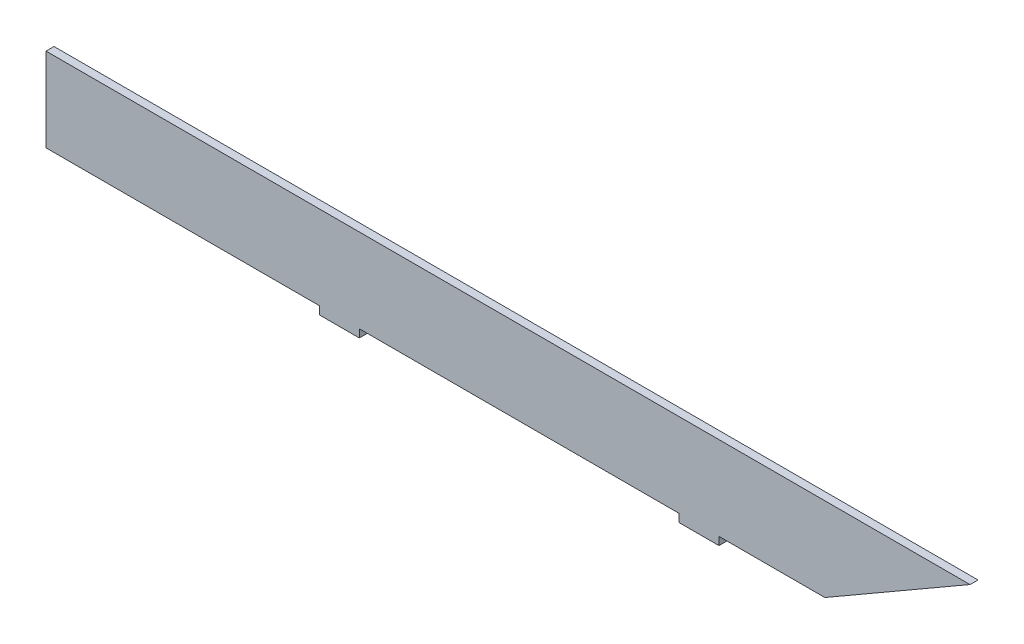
ISO-10303-21;
HEADER;
FILE_DESCRIPTION(('STEP AP214'),'2;1');
FILE_NAME('part.step','',(''),(''),'','','');
FILE_SCHEMA(('AUTOMOTIVE_DESIGN { 1 0 10303 214 1 1 1 1 }'));
ENDSEC;
DATA;
#1=APPLICATION_CONTEXT('core data for automotive mechanical design processes');
#2=APPLICATION_PROTOCOL_DEFINITION('international standard','automotive_design',2000,#1);
#3=PRODUCT_CONTEXT('',#1,'mechanical');
#4=PRODUCT('Part','Part','',(#3));
#5=PRODUCT_RELATED_PRODUCT_CATEGORY('part','',(#4));
#6=PRODUCT_DEFINITION_FORMATION('','',#4);
#7=PRODUCT_DEFINITION_CONTEXT('part definition',#1,'design');
#8=PRODUCT_DEFINITION('design','',#6,#7);
#9=PRODUCT_DEFINITION_SHAPE('','',#8);
#10=(LENGTH_UNIT() NAMED_UNIT(*) SI_UNIT(.MILLI.,.METRE.));
#11=(NAMED_UNIT(*) PLANE_ANGLE_UNIT() SI_UNIT($,.RADIAN.));
#12=(NAMED_UNIT(*) SI_UNIT($,.STERADIAN.) SOLID_ANGLE_UNIT());
#13=UNCERTAINTY_MEASURE_WITH_UNIT(LENGTH_MEASURE(1.E-05),#10,'distance_accuracy_value','');
#14=(GEOMETRIC_REPRESENTATION_CONTEXT(3) GLOBAL_UNCERTAINTY_ASSIGNED_CONTEXT((#13)) GLOBAL_UNIT_ASSIGNED_CONTEXT((#10,
#11,#12)) REPRESENTATION_CONTEXT('',''));
#15=CARTESIAN_POINT('',(0.,0.,0.));
#16=DIRECTION('',(0.,0.,1.));
#17=DIRECTION('',(1.,0.,0.));
#18=AXIS2_PLACEMENT_3D('',#15,#16,#17);
#19=CARTESIAN_POINT('',(0.,0.,2.));
#20=DIRECTION('',(0.,0.,1.));
#21=DIRECTION('',(1.,0.,0.));
#22=AXIS2_PLACEMENT_3D('',#19,#20,#21);
#23=PLANE('',#22);
#24=DIRECTION('',(0.,1.,0.));
#25=VECTOR('',#24,1.);
#26=CARTESIAN_POINT('',(168.6,-2.,2.));
#27=LINE('',#26,#25);
#28=CARTESIAN_POINT('',(168.6,0.,2.));
#29=VERTEX_POINT('',#28);
#30=CARTESIAN_POINT('',(168.6,-2.,2.));
#31=VERTEX_POINT('',#30);
#32=EDGE_CURVE('E129',#29,#31,#27,.F.);
#33=ORIENTED_EDGE('',*,*,#32,.F.);
#34=DIRECTION('',(1.,0.,0.));
#35=VECTOR('',#34,1.);
#36=CARTESIAN_POINT('',(0.,0.,2.));
#37=LINE('',#36,#35);
#38=CARTESIAN_POINT('',(195.1269330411,0.,1.99999999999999));
#39=VERTEX_POINT('',#38);
#40=EDGE_CURVE('E133',#39,#29,#37,.F.);
#41=ORIENTED_EDGE('',*,*,#40,.F.);
#42=DIRECTION('',(0.866025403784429,0.500000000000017,0.));
#43=VECTOR('',#42,1.);
#44=CARTESIAN_POINT('',(195.1269330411,0.,1.99999999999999));
#45=LINE('',#44,#43);
#46=CARTESIAN_POINT('',(231.500000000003,20.9999999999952,2.));
#47=VERTEX_POINT('',#46);
#48=EDGE_CURVE('E137',#47,#39,#45,.F.);
#49=ORIENTED_EDGE('',*,*,#48,.F.);
#50=DIRECTION('',(1.,0.,0.));
#51=VECTOR('',#50,1.);
#52=CARTESIAN_POINT('',(231.5,21.,2.));
#53=LINE('',#52,#51);
#54=CARTESIAN_POINT('',(0.,21.,2.));
#55=VERTEX_POINT('',#54);
#56=EDGE_CURVE('E141',#55,#47,#53,.T.);
#57=ORIENTED_EDGE('',*,*,#56,.F.);
#58=DIRECTION('',(0.,1.,0.));
#59=VECTOR('',#58,1.);
#60=CARTESIAN_POINT('',(0.,21.,2.));
#61=LINE('',#60,#59);
#62=CARTESIAN_POINT('',(0.,0.,2.));
#63=VERTEX_POINT('',#62);
#64=EDGE_CURVE('E145',#63,#55,#61,.T.);
#65=ORIENTED_EDGE('',*,*,#64,.F.);
#66=DIRECTION('',(1.,0.,0.));
#67=VECTOR('',#66,1.);
#68=CARTESIAN_POINT('',(0.,0.,2.));
#69=LINE('',#68,#67);
#70=CARTESIAN_POINT('',(68.5000000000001,0.,2.));
#71=VERTEX_POINT('',#70);
#72=EDGE_CURVE('E149',#71,#63,#69,.F.);
#73=ORIENTED_EDGE('',*,*,#72,.F.);
#74=DIRECTION('',(0.,1.,0.));
#75=VECTOR('',#74,1.);
#76=CARTESIAN_POINT('',(68.5000000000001,0.,2.));
#77=LINE('',#76,#75);
#78=CARTESIAN_POINT('',(68.5000000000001,-2.,2.));
#79=VERTEX_POINT('',#78);
#80=EDGE_CURVE('E153',#79,#71,#77,.T.);
#81=ORIENTED_EDGE('',*,*,#80,.F.);
#82=DIRECTION('',(1.,0.,0.));
#83=VECTOR('',#82,1.);
#84=CARTESIAN_POINT('',(68.5000000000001,-2.,2.));
#85=LINE('',#84,#83);
#86=CARTESIAN_POINT('',(78.5,-2.,2.));
#87=VERTEX_POINT('',#86);
#88=EDGE_CURVE('E159',#87,#79,#85,.F.);
#89=ORIENTED_EDGE('',*,*,#88,.F.);
#90=DIRECTION('',(0.,1.,0.));
#91=VECTOR('',#90,1.);
#92=CARTESIAN_POINT('',(78.5,-2.,2.));
#93=LINE('',#92,#91);
#94=CARTESIAN_POINT('',(78.5,0.,2.));
#95=VERTEX_POINT('',#94);
#96=EDGE_CURVE('E117',#95,#87,#93,.F.);
#97=ORIENTED_EDGE('',*,*,#96,.F.);
#98=DIRECTION('',(1.,0.,0.));
#99=VECTOR('',#98,1.);
#100=CARTESIAN_POINT('',(0.,0.,2.));
#101=LINE('',#100,#99);
#102=CARTESIAN_POINT('',(158.6,0.,1.99999999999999));
#103=VERTEX_POINT('',#102);
#104=EDGE_CURVE('E21',#103,#95,#101,.F.);
#105=ORIENTED_EDGE('',*,*,#104,.F.);
#106=DIRECTION('',(0.,1.,0.));
#107=VECTOR('',#106,1.);
#108=CARTESIAN_POINT('',(158.6,0.,1.99999999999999));
#109=LINE('',#108,#107);
#110=CARTESIAN_POINT('',(158.6,-2.,1.99999999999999));
#111=VERTEX_POINT('',#110);
#112=EDGE_CURVE('E104',#111,#103,#109,.T.);
#113=ORIENTED_EDGE('',*,*,#112,.F.);
#114=DIRECTION('',(1.,0.,0.));
#115=VECTOR('',#114,1.);
#116=CARTESIAN_POINT('',(158.6,-2.,1.99999999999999));
#117=LINE('',#116,#115);
#118=EDGE_CURVE('E125',#31,#111,#117,.F.);
#119=ORIENTED_EDGE('',*,*,#118,.F.);
#120=EDGE_LOOP('',(#33,#41,#49,#57,#65,#73,#81,#89,#97,#105,#113,#119));
#121=FACE_BOUND('',#120,.T.);
#122=ADVANCED_FACE('F18',(#121),#23,.T.);
#123=CARTESIAN_POINT('',(0.,0.,0.));
#124=DIRECTION('',(0.,-1.,0.));
#125=DIRECTION('',(0.,0.,-1.));
#126=AXIS2_PLACEMENT_3D('',#123,#124,#125);
#127=PLANE('',#126);
#128=ORIENTED_EDGE('',*,*,#104,.T.);
#129=DIRECTION('',(0.,0.,-1.));
#130=VECTOR('',#129,1.);
#131=CARTESIAN_POINT('',(78.5,0.,2.));
#132=LINE('',#131,#130);
#133=CARTESIAN_POINT('',(78.5,0.,0.));
#134=VERTEX_POINT('',#133);
#135=EDGE_CURVE('E164',#134,#95,#132,.F.);
#136=ORIENTED_EDGE('',*,*,#135,.F.);
#137=DIRECTION('',(1.,0.,0.));
#138=VECTOR('',#137,1.);
#139=CARTESIAN_POINT('',(0.,0.,0.));
#140=LINE('',#139,#138);
#141=CARTESIAN_POINT('',(158.6,0.,0.));
#142=VERTEX_POINT('',#141);
#143=EDGE_CURVE('E123',#134,#142,#140,.T.);
#144=ORIENTED_EDGE('',*,*,#143,.T.);
#145=DIRECTION('',(0.,0.,1.));
#146=VECTOR('',#145,1.);
#147=CARTESIAN_POINT('',(158.6,0.,1.99999999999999));
#148=LINE('',#147,#146);
#149=EDGE_CURVE('E111',#103,#142,#148,.F.);
#150=ORIENTED_EDGE('',*,*,#149,.F.);
#151=EDGE_LOOP('',(#128,#136,#144,#150));
#152=FACE_BOUND('',#151,.T.);
#153=ADVANCED_FACE('F122',(#152),#127,.T.);
#154=CARTESIAN_POINT('',(158.6,0.,1.99999999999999));
#155=DIRECTION('',(-1.,0.,0.));
#156=DIRECTION('',(0.,0.,1.));
#157=AXIS2_PLACEMENT_3D('',#154,#155,#156);
#158=PLANE('',#157);
#159=ORIENTED_EDGE('',*,*,#112,.T.);
#160=ORIENTED_EDGE('',*,*,#149,.T.);
#161=DIRECTION('',(0.,1.,0.));
#162=VECTOR('',#161,1.);
#163=CARTESIAN_POINT('',(158.6,0.,0.));
#164=LINE('',#163,#162);
#165=CARTESIAN_POINT('',(158.6,-2.,0.));
#166=VERTEX_POINT('',#165);
#167=EDGE_CURVE('E167',#142,#166,#164,.F.);
#168=ORIENTED_EDGE('',*,*,#167,.T.);
#169=DIRECTION('',(0.,0.,-1.));
#170=VECTOR('',#169,1.);
#171=CARTESIAN_POINT('',(158.6,-2.,1.99999999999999));
#172=LINE('',#171,#170);
#173=EDGE_CURVE('E113',#111,#166,#172,.T.);
#174=ORIENTED_EDGE('',*,*,#173,.F.);
#175=EDGE_LOOP('',(#159,#160,#168,#174));
#176=FACE_BOUND('',#175,.T.);
#177=ADVANCED_FACE('F108',(#176),#158,.T.);
#178=CARTESIAN_POINT('',(158.6,-2.,1.99999999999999));
#179=DIRECTION('',(0.,-1.,0.));
#180=DIRECTION('',(0.,0.,-1.));
#181=AXIS2_PLACEMENT_3D('',#178,#179,#180);
#182=PLANE('',#181);
#183=DIRECTION('',(0.,0.,-1.));
#184=VECTOR('',#183,1.);
#185=CARTESIAN_POINT('',(168.6,-2.,2.));
#186=LINE('',#185,#184);
#187=CARTESIAN_POINT('',(168.6,-2.,0.));
#188=VERTEX_POINT('',#187);
#189=EDGE_CURVE('E131',#31,#188,#186,.T.);
#190=ORIENTED_EDGE('',*,*,#189,.F.);
#191=ORIENTED_EDGE('',*,*,#118,.T.);
#192=ORIENTED_EDGE('',*,*,#173,.T.);
#193=DIRECTION('',(1.,0.,0.));
#194=VECTOR('',#193,1.);
#195=CARTESIAN_POINT('',(0.,-2.,0.));
#196=LINE('',#195,#194);
#197=EDGE_CURVE('E169',#166,#188,#196,.T.);
#198=ORIENTED_EDGE('',*,*,#197,.T.);
#199=EDGE_LOOP('',(#190,#191,#192,#198));
#200=FACE_BOUND('',#199,.T.);
#201=ADVANCED_FACE('F235',(#200),#182,.T.);
#202=CARTESIAN_POINT('',(168.6,-2.,2.));
#203=DIRECTION('',(1.,0.,0.));
#204=DIRECTION('',(0.,0.,-1.));
#205=AXIS2_PLACEMENT_3D('',#202,#203,#204);
#206=PLANE('',#205);
#207=DIRECTION('',(0.,1.,0.));
#208=VECTOR('',#207,1.);
#209=CARTESIAN_POINT('',(168.6,0.,0.));
#210=LINE('',#209,#208);
#211=CARTESIAN_POINT('',(168.6,0.,0.));
#212=VERTEX_POINT('',#211);
#213=EDGE_CURVE('E172',#188,#212,#210,.T.);
#214=ORIENTED_EDGE('',*,*,#213,.T.);
#215=DIRECTION('',(0.,0.,-1.));
#216=VECTOR('',#215,1.);
#217=CARTESIAN_POINT('',(168.6,0.,0.));
#218=LINE('',#217,#216);
#219=EDGE_CURVE('E135',#29,#212,#218,.T.);
#220=ORIENTED_EDGE('',*,*,#219,.F.);
#221=ORIENTED_EDGE('',*,*,#32,.T.);
#222=ORIENTED_EDGE('',*,*,#189,.T.);
#223=EDGE_LOOP('',(#214,#220,#221,#222));
#224=FACE_BOUND('',#223,.T.);
#225=ADVANCED_FACE('F232',(#224),#206,.T.);
#226=CARTESIAN_POINT('',(0.,0.,0.));
#227=DIRECTION('',(0.,-1.,0.));
#228=DIRECTION('',(0.,0.,-1.));
#229=AXIS2_PLACEMENT_3D('',#226,#227,#228);
#230=PLANE('',#229);
#231=ORIENTED_EDGE('',*,*,#40,.T.);
#232=ORIENTED_EDGE('',*,*,#219,.T.);
#233=DIRECTION('',(1.,0.,0.));
#234=VECTOR('',#233,1.);
#235=CARTESIAN_POINT('',(0.,0.,0.));
#236=LINE('',#235,#234);
#237=CARTESIAN_POINT('',(195.1269330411,0.,0.));
#238=VERTEX_POINT('',#237);
#239=EDGE_CURVE('E175',#212,#238,#236,.T.);
#240=ORIENTED_EDGE('',*,*,#239,.T.);
#241=DIRECTION('',(0.,0.,1.));
#242=VECTOR('',#241,1.);
#243=CARTESIAN_POINT('',(195.1269330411,0.,0.));
#244=LINE('',#243,#242);
#245=EDGE_CURVE('E139',#39,#238,#244,.F.);
#246=ORIENTED_EDGE('',*,*,#245,.F.);
#247=EDGE_LOOP('',(#231,#232,#240,#246));
#248=FACE_BOUND('',#247,.T.);
#249=ADVANCED_FACE('F227',(#248),#230,.T.);
#250=CARTESIAN_POINT('',(195.1269330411,0.,0.));
#251=DIRECTION('',(0.500000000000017,-0.86602540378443,0.));
#252=DIRECTION('',(0.866025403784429,0.500000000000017,0.));
#253=AXIS2_PLACEMENT_3D('',#250,#251,#252);
#254=PLANE('',#253);
#255=ORIENTED_EDGE('',*,*,#245,.T.);
#256=DIRECTION('',(0.866025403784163,0.500000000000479,0.));
#257=VECTOR('',#256,1.);
#258=CARTESIAN_POINT('',(195.1269330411,0.,0.));
#259=LINE('',#258,#257);
#260=CARTESIAN_POINT('',(231.500000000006,20.9999999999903,0.));
#261=VERTEX_POINT('',#260);
#262=EDGE_CURVE('E178',#238,#261,#259,.T.);
#263=ORIENTED_EDGE('',*,*,#262,.T.);
#264=DIRECTION('',(0.,0.,1.));
#265=VECTOR('',#264,1.);
#266=CARTESIAN_POINT('',(231.5,21.,0.));
#267=LINE('',#266,#265);
#268=EDGE_CURVE('E143',#47,#261,#267,.F.);
#269=ORIENTED_EDGE('',*,*,#268,.F.);
#270=ORIENTED_EDGE('',*,*,#48,.T.);
#271=EDGE_LOOP('',(#255,#263,#269,#270));
#272=FACE_BOUND('',#271,.T.);
#273=ADVANCED_FACE('F223',(#272),#254,.T.);
#274=CARTESIAN_POINT('',(231.5,21.,0.));
#275=DIRECTION('',(0.,1.,0.));
#276=DIRECTION('',(0.,0.,1.));
#277=AXIS2_PLACEMENT_3D('',#274,#275,#276);
#278=PLANE('',#277);
#279=ORIENTED_EDGE('',*,*,#268,.T.);
#280=DIRECTION('',(1.,0.,0.));
#281=VECTOR('',#280,1.);
#282=CARTESIAN_POINT('',(0.,21.,0.));
#283=LINE('',#282,#281);
#284=CARTESIAN_POINT('',(0.,21.,0.));
#285=VERTEX_POINT('',#284);
#286=EDGE_CURVE('E181',#261,#285,#283,.F.);
#287=ORIENTED_EDGE('',*,*,#286,.T.);
#288=DIRECTION('',(0.,0.,1.));
#289=VECTOR('',#288,1.);
#290=CARTESIAN_POINT('',(0.,21.,0.));
#291=LINE('',#290,#289);
#292=EDGE_CURVE('E147',#55,#285,#291,.F.);
#293=ORIENTED_EDGE('',*,*,#292,.F.);
#294=ORIENTED_EDGE('',*,*,#56,.T.);
#295=EDGE_LOOP('',(#279,#287,#293,#294));
#296=FACE_BOUND('',#295,.T.);
#297=ADVANCED_FACE('F217',(#296),#278,.T.);
#298=CARTESIAN_POINT('',(0.,21.,0.));
#299=DIRECTION('',(-1.,0.,0.));
#300=DIRECTION('',(0.,0.,1.));
#301=AXIS2_PLACEMENT_3D('',#298,#299,#300);
#302=PLANE('',#301);
#303=ORIENTED_EDGE('',*,*,#292,.T.);
#304=DIRECTION('',(0.,1.,0.));
#305=VECTOR('',#304,1.);
#306=CARTESIAN_POINT('',(0.,0.,0.));
#307=LINE('',#306,#305);
#308=CARTESIAN_POINT('',(0.,0.,0.));
#309=VERTEX_POINT('',#308);
#310=EDGE_CURVE('E184',#285,#309,#307,.F.);
#311=ORIENTED_EDGE('',*,*,#310,.T.);
#312=DIRECTION('',(0.,0.,-1.));
#313=VECTOR('',#312,1.);
#314=CARTESIAN_POINT('',(0.,0.,0.));
#315=LINE('',#314,#313);
#316=EDGE_CURVE('E151',#63,#309,#315,.T.);
#317=ORIENTED_EDGE('',*,*,#316,.F.);
#318=ORIENTED_EDGE('',*,*,#64,.T.);
#319=EDGE_LOOP('',(#303,#311,#317,#318));
#320=FACE_BOUND('',#319,.T.);
#321=ADVANCED_FACE('F213',(#320),#302,.T.);
#322=CARTESIAN_POINT('',(0.,0.,0.));
#323=DIRECTION('',(0.,-1.,0.));
#324=DIRECTION('',(0.,0.,-1.));
#325=AXIS2_PLACEMENT_3D('',#322,#323,#324);
#326=PLANE('',#325);
#327=DIRECTION('',(1.,0.,0.));
#328=VECTOR('',#327,1.);
#329=CARTESIAN_POINT('',(0.,0.,0.));
#330=LINE('',#329,#328);
#331=CARTESIAN_POINT('',(68.5,0.,0.));
#332=VERTEX_POINT('',#331);
#333=EDGE_CURVE('E187',#309,#332,#330,.T.);
#334=ORIENTED_EDGE('',*,*,#333,.T.);
#335=DIRECTION('',(0.,0.,1.));
#336=VECTOR('',#335,1.);
#337=CARTESIAN_POINT('',(68.5000000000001,0.,2.));
#338=LINE('',#337,#336);
#339=EDGE_CURVE('E155',#71,#332,#338,.F.);
#340=ORIENTED_EDGE('',*,*,#339,.F.);
#341=ORIENTED_EDGE('',*,*,#72,.T.);
#342=ORIENTED_EDGE('',*,*,#316,.T.);
#343=EDGE_LOOP('',(#334,#340,#341,#342));
#344=FACE_BOUND('',#343,.T.);
#345=ADVANCED_FACE('F207',(#344),#326,.T.);
#346=CARTESIAN_POINT('',(68.5000000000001,0.,2.));
#347=DIRECTION('',(-1.,0.,0.));
#348=DIRECTION('',(0.,0.,1.));
#349=AXIS2_PLACEMENT_3D('',#346,#347,#348);
#350=PLANE('',#349);
#351=ORIENTED_EDGE('',*,*,#80,.T.);
#352=ORIENTED_EDGE('',*,*,#339,.T.);
#353=DIRECTION('',(0.,1.,0.));
#354=VECTOR('',#353,1.);
#355=CARTESIAN_POINT('',(68.5,0.,0.));
#356=LINE('',#355,#354);
#357=CARTESIAN_POINT('',(68.5,-2.,0.));
#358=VERTEX_POINT('',#357);
#359=EDGE_CURVE('E190',#332,#358,#356,.F.);
#360=ORIENTED_EDGE('',*,*,#359,.T.);
#361=DIRECTION('',(0.,0.,-1.));
#362=VECTOR('',#361,1.);
#363=CARTESIAN_POINT('',(68.5000000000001,-2.,2.));
#364=LINE('',#363,#362);
#365=EDGE_CURVE('E157',#79,#358,#364,.T.);
#366=ORIENTED_EDGE('',*,*,#365,.F.);
#367=EDGE_LOOP('',(#351,#352,#360,#366));
#368=FACE_BOUND('',#367,.T.);
#369=ADVANCED_FACE('F203',(#368),#350,.T.);
#370=CARTESIAN_POINT('',(68.5000000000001,-2.,2.));
#371=DIRECTION('',(0.,-1.,0.));
#372=DIRECTION('',(0.,0.,-1.));
#373=AXIS2_PLACEMENT_3D('',#370,#371,#372);
#374=PLANE('',#373);
#375=DIRECTION('',(0.,0.,-1.));
#376=VECTOR('',#375,1.);
#377=CARTESIAN_POINT('',(78.5,-2.,2.));
#378=LINE('',#377,#376);
#379=CARTESIAN_POINT('',(78.5,-2.,0.));
#380=VERTEX_POINT('',#379);
#381=EDGE_CURVE('E35',#87,#380,#378,.T.);
#382=ORIENTED_EDGE('',*,*,#381,.F.);
#383=ORIENTED_EDGE('',*,*,#88,.T.);
#384=ORIENTED_EDGE('',*,*,#365,.T.);
#385=DIRECTION('',(1.,0.,0.));
#386=VECTOR('',#385,1.);
#387=CARTESIAN_POINT('',(0.,-2.,0.));
#388=LINE('',#387,#386);
#389=EDGE_CURVE('E27',#358,#380,#388,.T.);
#390=ORIENTED_EDGE('',*,*,#389,.T.);
#391=EDGE_LOOP('',(#382,#383,#384,#390));
#392=FACE_BOUND('',#391,.T.);
#393=ADVANCED_FACE('F196',(#392),#374,.T.);
#394=CARTESIAN_POINT('',(78.5,-2.,2.));
#395=DIRECTION('',(1.,0.,0.));
#396=DIRECTION('',(0.,0.,-1.));
#397=AXIS2_PLACEMENT_3D('',#394,#395,#396);
#398=PLANE('',#397);
#399=DIRECTION('',(0.,1.,0.));
#400=VECTOR('',#399,1.);
#401=CARTESIAN_POINT('',(78.5,0.,0.));
#402=LINE('',#401,#400);
#403=EDGE_CURVE('E11',#380,#134,#402,.T.);
#404=ORIENTED_EDGE('',*,*,#403,.T.);
#405=ORIENTED_EDGE('',*,*,#135,.T.);
#406=ORIENTED_EDGE('',*,*,#96,.T.);
#407=ORIENTED_EDGE('',*,*,#381,.T.);
#408=EDGE_LOOP('',(#404,#405,#406,#407));
#409=FACE_BOUND('',#408,.T.);
#410=ADVANCED_FACE('F236',(#409),#398,.T.);
#411=CARTESIAN_POINT('',(0.,0.,0.));
#412=DIRECTION('',(0.,0.,1.));
#413=DIRECTION('',(1.,0.,0.));
#414=AXIS2_PLACEMENT_3D('',#411,#412,#413);
#415=PLANE('',#414);
#416=ORIENTED_EDGE('',*,*,#389,.F.);
#417=ORIENTED_EDGE('',*,*,#359,.F.);
#418=ORIENTED_EDGE('',*,*,#333,.F.);
#419=ORIENTED_EDGE('',*,*,#310,.F.);
#420=ORIENTED_EDGE('',*,*,#286,.F.);
#421=ORIENTED_EDGE('',*,*,#262,.F.);
#422=ORIENTED_EDGE('',*,*,#239,.F.);
#423=ORIENTED_EDGE('',*,*,#213,.F.);
#424=ORIENTED_EDGE('',*,*,#197,.F.);
#425=ORIENTED_EDGE('',*,*,#167,.F.);
#426=ORIENTED_EDGE('',*,*,#143,.F.);
#427=ORIENTED_EDGE('',*,*,#403,.F.);
#428=EDGE_LOOP('',(#416,#417,#418,#419,#420,#421,#422,#423,#424,#425,#426,#427));
#429=FACE_BOUND('',#428,.T.);
#430=ADVANCED_FACE('F200',(#429),#415,.F.);
#431=CLOSED_SHELL('',(#122,#153,#177,#201,#225,#249,#273,#297,#321,#345,#369,#393,#410,#430));
#432=MANIFOLD_SOLID_BREP('B1',#431);
#433=ADVANCED_BREP_SHAPE_REPRESENTATION('',(#18,#432),#14);
#434=SHAPE_DEFINITION_REPRESENTATION(#9,#433);
ENDSEC;
END-ISO-10303-21;
